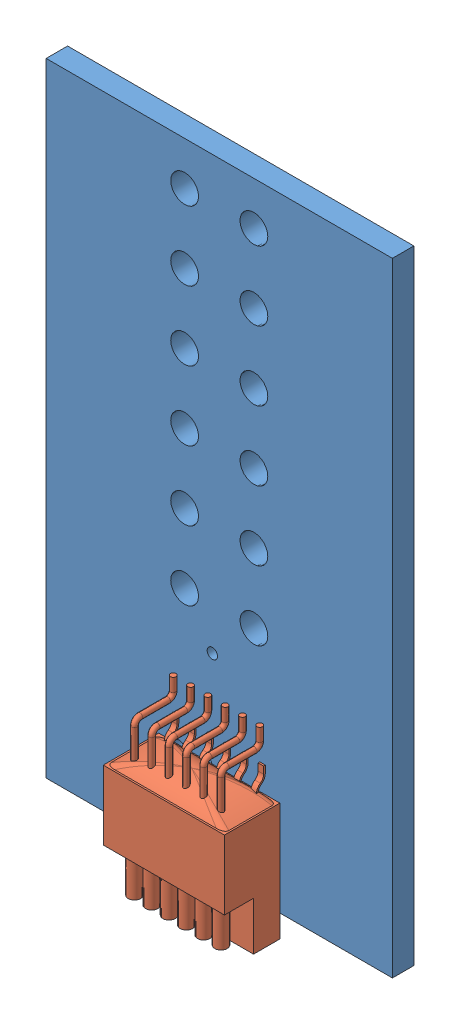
SolidWorks assembly RHD_SPI_Cable_Adapter.SLDASM, configuration Default (file format 15000). Lengths in mm.
Overall size (12.7 23.69 2.83).
2 component instances, 2 part files, 2 mates.
Components (placement in the parent):
- RHD_SPI_Cable_Adapter_PCB-1: RHD_SPI_Cable_Adapter_PCB.SLDPRT [Default] at origin size (12.7 22.86 0.79)
- A79623-001-1: A79623-001.SLDPRT [Default] at (6.35 3.4925 0.7874) x (1 0 0) z (0 -1 0) size (4.45 2.05 6.53)
Mates (geometry in assembly coordinates):
- Coincident1: coincident anti-aligned: plane of rhd2000_cable_adapt2-1 through (0 0 0.7874) normal (0 0 1); plane of A79623-001-1 through (6.35 3.4925 0.7874) normal (0 0 -1)
- Parallel1: parallel aligned: plane of rhd2000_cable_adapt2-1 through (12.7 0 0.7874) normal (0 -1 0); plane of A79623-001-1 through (8.5725 -0.8255 0.7874) normal (0 -1 0)
